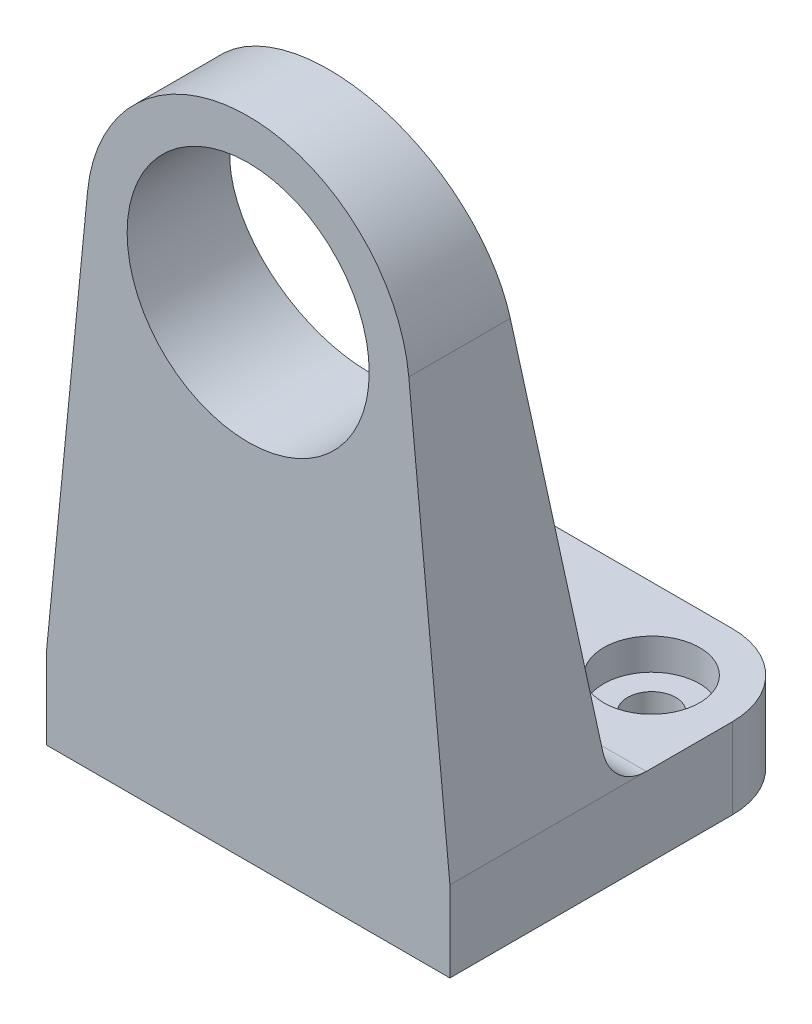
ISO-10303-21;
HEADER;
FILE_DESCRIPTION(('STEP AP214'),'2;1');
FILE_NAME('part.step','',(''),(''),'','','');
FILE_SCHEMA(('AUTOMOTIVE_DESIGN { 1 0 10303 214 1 1 1 1 }'));
ENDSEC;
DATA;
#1=APPLICATION_CONTEXT('core data for automotive mechanical design processes');
#2=APPLICATION_PROTOCOL_DEFINITION('international standard','automotive_design',2000,#1);
#3=PRODUCT_CONTEXT('',#1,'mechanical');
#4=PRODUCT('Part','Part','',(#3));
#5=PRODUCT_RELATED_PRODUCT_CATEGORY('part','',(#4));
#6=PRODUCT_DEFINITION_FORMATION('','',#4);
#7=PRODUCT_DEFINITION_CONTEXT('part definition',#1,'design');
#8=PRODUCT_DEFINITION('design','',#6,#7);
#9=PRODUCT_DEFINITION_SHAPE('','',#8);
#10=(LENGTH_UNIT() NAMED_UNIT(*) SI_UNIT(.MILLI.,.METRE.));
#11=(NAMED_UNIT(*) PLANE_ANGLE_UNIT() SI_UNIT($,.RADIAN.));
#12=(NAMED_UNIT(*) SI_UNIT($,.STERADIAN.) SOLID_ANGLE_UNIT());
#13=UNCERTAINTY_MEASURE_WITH_UNIT(LENGTH_MEASURE(1.E-05),#10,'distance_accuracy_value','');
#14=(GEOMETRIC_REPRESENTATION_CONTEXT(3) GLOBAL_UNCERTAINTY_ASSIGNED_CONTEXT((#13)) GLOBAL_UNIT_ASSIGNED_CONTEXT((#10,
#11,#12)) REPRESENTATION_CONTEXT('',''));
#15=CARTESIAN_POINT('',(0.,0.,0.));
#16=DIRECTION('',(0.,0.,1.));
#17=DIRECTION('',(1.,0.,0.));
#18=AXIS2_PLACEMENT_3D('',#15,#16,#17);
#19=CARTESIAN_POINT('',(15.875,50.8,0.));
#20=DIRECTION('',(0.,0.,-1.));
#21=DIRECTION('',(0.,1.,0.));
#22=AXIS2_PLACEMENT_3D('',#19,#20,#21);
#23=PLANE('',#22);
#24=CARTESIAN_POINT('',(0.,38.1,0.));
#25=DIRECTION('',(0.,0.,1.));
#26=DIRECTION('',(1.,0.,0.));
#27=AXIS2_PLACEMENT_3D('',#24,#25,#26);
#28=CIRCLE('',#27,9.525);
#29=CARTESIAN_POINT('',(9.525,38.1,0.));
#30=VERTEX_POINT('',#29);
#31=EDGE_CURVE('E163',#30,#30,#28,.T.);
#32=ORIENTED_EDGE('',*,*,#31,.F.);
#33=EDGE_LOOP('',(#32));
#34=FACE_BOUND('',#33,.T.);
#35=DIRECTION('',(-0.0976122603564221,0.995224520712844,0.));
#36=VECTOR('',#35,1.);
#37=CARTESIAN_POINT('',(15.875,6.34999999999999,0.));
#38=LINE('',#37,#36);
#39=CARTESIAN_POINT('',(15.875,6.34999999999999,0.));
#40=VERTEX_POINT('',#39);
#41=CARTESIAN_POINT('',(12.6393514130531,39.3396757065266,0.));
#42=VERTEX_POINT('',#41);
#43=EDGE_CURVE('E121',#40,#42,#38,.T.);
#44=ORIENTED_EDGE('',*,*,#43,.T.);
#45=CARTESIAN_POINT('',(0.,38.1,0.));
#46=DIRECTION('',(0.,0.,1.));
#47=DIRECTION('',(1.,0.,0.));
#48=AXIS2_PLACEMENT_3D('',#45,#46,#47);
#49=CIRCLE('',#48,12.7);
#50=CARTESIAN_POINT('',(-12.6393514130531,39.3396757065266,0.));
#51=VERTEX_POINT('',#50);
#52=EDGE_CURVE('E119',#42,#51,#49,.T.);
#53=ORIENTED_EDGE('',*,*,#52,.T.);
#54=DIRECTION('',(-0.0976122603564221,-0.995224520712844,0.));
#55=VECTOR('',#54,1.);
#56=CARTESIAN_POINT('',(-15.875,6.34999999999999,0.));
#57=LINE('',#56,#55);
#58=CARTESIAN_POINT('',(-15.875,6.34999999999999,0.));
#59=VERTEX_POINT('',#58);
#60=EDGE_CURVE('E107',#51,#59,#57,.T.);
#61=ORIENTED_EDGE('',*,*,#60,.T.);
#62=DIRECTION('',(0.,-1.,0.));
#63=VECTOR('',#62,1.);
#64=CARTESIAN_POINT('',(-15.875,50.8,0.));
#65=LINE('',#64,#63);
#66=CARTESIAN_POINT('',(-15.875,0.,0.));
#67=VERTEX_POINT('',#66);
#68=EDGE_CURVE('E117',#59,#67,#65,.T.);
#69=ORIENTED_EDGE('',*,*,#68,.T.);
#70=DIRECTION('',(-1.,0.,0.));
#71=VECTOR('',#70,1.);
#72=CARTESIAN_POINT('',(15.875,0.,0.));
#73=LINE('',#72,#71);
#74=CARTESIAN_POINT('',(15.875,0.,0.));
#75=VERTEX_POINT('',#74);
#76=EDGE_CURVE('E112',#75,#67,#73,.T.);
#77=ORIENTED_EDGE('',*,*,#76,.F.);
#78=DIRECTION('',(0.,-1.,0.));
#79=VECTOR('',#78,1.);
#80=CARTESIAN_POINT('',(15.875,50.8,0.));
#81=LINE('',#80,#79);
#82=EDGE_CURVE('E135',#40,#75,#81,.T.);
#83=ORIENTED_EDGE('',*,*,#82,.F.);
#84=EDGE_LOOP('',(#44,#53,#61,#69,#77,#83));
#85=FACE_BOUND('',#84,.T.);
#86=ADVANCED_FACE('F24',(#34,#85),#23,.F.);
#87=CARTESIAN_POINT('',(15.875,6.34999999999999,-12.7));
#88=DIRECTION('',(0.,-0.14142135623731,0.989949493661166));
#89=DIRECTION('',(0.,-0.989949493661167,-0.14142135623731));
#90=AXIS2_PLACEMENT_3D('',#87,#88,#89);
#91=PLANE('',#90);
#92=CARTESIAN_POINT('',(0.,38.1,-8.16428571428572));
#93=DIRECTION('',(0.,-0.14142135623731,0.989949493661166));
#94=DIRECTION('',(0.,0.989949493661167,0.14142135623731));
#95=AXIS2_PLACEMENT_3D('',#92,#93,#94);
#96=ELLIPSE('',#95,9.62170298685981,9.525);
#97=CARTESIAN_POINT('',(0.,47.625,-6.80357142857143));
#98=VERTEX_POINT('',#97);
#99=EDGE_CURVE('E160',#98,#98,#96,.T.);
#100=ORIENTED_EDGE('',*,*,#99,.T.);
#101=EDGE_LOOP('',(#100));
#102=FACE_BOUND('',#101,.T.);
#103=DIRECTION('',(-0.0966404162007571,0.9853158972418,0.140759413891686));
#104=VECTOR('',#103,1.);
#105=CARTESIAN_POINT('',(15.875,6.34999999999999,-12.7));
#106=LINE('',#105,#104);
#107=CARTESIAN_POINT('',(15.6076334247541,9.07598719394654,-12.3105732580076));
#108=VERTEX_POINT('',#107);
#109=CARTESIAN_POINT('',(12.6393514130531,39.3396757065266,-7.98718918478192));
#110=VERTEX_POINT('',#109);
#111=EDGE_CURVE('E130',#108,#110,#106,.T.);
#112=ORIENTED_EDGE('',*,*,#111,.F.);
#113=DIRECTION('',(-1.,0.,0.));
#114=VECTOR('',#113,1.);
#115=CARTESIAN_POINT('',(-15.875,9.07598719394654,-12.3105732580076));
#116=LINE('',#115,#114);
#117=CARTESIAN_POINT('',(-15.6076334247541,9.07598719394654,-12.3105732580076));
#118=VERTEX_POINT('',#117);
#119=EDGE_CURVE('E150',#108,#118,#116,.T.);
#120=ORIENTED_EDGE('',*,*,#119,.T.);
#121=DIRECTION('',(-0.0966404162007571,-0.9853158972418,-0.140759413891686));
#122=VECTOR('',#121,1.);
#123=CARTESIAN_POINT('',(-15.5784750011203,9.37327749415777,-12.2681032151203));
#124=LINE('',#123,#122);
#125=CARTESIAN_POINT('',(-12.6393514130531,39.3396757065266,-7.98718918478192));
#126=VERTEX_POINT('',#125);
#127=EDGE_CURVE('E207',#126,#118,#124,.T.);
#128=ORIENTED_EDGE('',*,*,#127,.F.);
#129=CARTESIAN_POINT('',(0.,38.1,-8.16428571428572));
#130=DIRECTION('',(0.,-0.14142135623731,0.989949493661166));
#131=DIRECTION('',(0.,0.989949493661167,0.14142135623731));
#132=AXIS2_PLACEMENT_3D('',#129,#130,#131);
#133=ELLIPSE('',#132,12.8289373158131,12.7);
#134=EDGE_CURVE('E126',#110,#126,#133,.T.);
#135=ORIENTED_EDGE('',*,*,#134,.F.);
#136=EDGE_LOOP('',(#112,#120,#128,#135));
#137=FACE_BOUND('',#136,.T.);
#138=ADVANCED_FACE('F205',(#102,#137),#91,.F.);
#139=CARTESIAN_POINT('',(15.875,0.,0.));
#140=DIRECTION('',(1.,0.,0.));
#141=DIRECTION('',(0.,0.,-1.));
#142=AXIS2_PLACEMENT_3D('',#139,#140,#141);
#143=PLANE('',#142);
#144=DIRECTION('',(0.,0.,-1.));
#145=VECTOR('',#144,1.);
#146=CARTESIAN_POINT('',(15.875,0.,0.));
#147=LINE('',#146,#145);
#148=CARTESIAN_POINT('',(15.875,0.,-22.225));
#149=VERTEX_POINT('',#148);
#150=EDGE_CURVE('E137',#75,#149,#147,.T.);
#151=ORIENTED_EDGE('',*,*,#150,.T.);
#152=DIRECTION('',(0.,1.,0.));
#153=VECTOR('',#152,1.);
#154=CARTESIAN_POINT('',(15.875,6.35,-22.225));
#155=LINE('',#154,#153);
#156=CARTESIAN_POINT('',(15.875,6.35,-22.225));
#157=VERTEX_POINT('',#156);
#158=EDGE_CURVE('E159',#149,#157,#155,.T.);
#159=ORIENTED_EDGE('',*,*,#158,.T.);
#160=DIRECTION('',(0.,0.,1.));
#161=VECTOR('',#160,1.);
#162=CARTESIAN_POINT('',(15.875,6.35,-28.575));
#163=LINE('',#162,#161);
#164=CARTESIAN_POINT('',(15.875,6.34999999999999,-15.4536629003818));
#165=VERTEX_POINT('',#164);
#166=EDGE_CURVE('E140',#157,#165,#163,.T.);
#167=ORIENTED_EDGE('',*,*,#166,.T.);
#168=DIRECTION('',(0.,0.,1.));
#169=VECTOR('',#168,1.);
#170=CARTESIAN_POINT('',(15.875,6.34999999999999,0.));
#171=LINE('',#170,#169);
#172=EDGE_CURVE('E111',#165,#40,#171,.T.);
#173=ORIENTED_EDGE('',*,*,#172,.T.);
#174=ORIENTED_EDGE('',*,*,#82,.T.);
#175=EDGE_LOOP('',(#151,#159,#167,#173,#174));
#176=FACE_BOUND('',#175,.T.);
#177=ADVANCED_FACE('F182',(#176),#143,.T.);
#178=CARTESIAN_POINT('',(-15.875,0.,0.));
#179=DIRECTION('',(1.,0.,0.));
#180=DIRECTION('',(0.,0.,-1.));
#181=AXIS2_PLACEMENT_3D('',#178,#179,#180);
#182=PLANE('',#181);
#183=DIRECTION('',(0.,0.,1.));
#184=VECTOR('',#183,1.);
#185=CARTESIAN_POINT('',(-15.875,6.35,-28.575));
#186=LINE('',#185,#184);
#187=CARTESIAN_POINT('',(-15.875,6.35,-22.225));
#188=VERTEX_POINT('',#187);
#189=CARTESIAN_POINT('',(-15.875,6.35,-15.4536629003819));
#190=VERTEX_POINT('',#189);
#191=EDGE_CURVE('E128',#188,#190,#186,.T.);
#192=ORIENTED_EDGE('',*,*,#191,.F.);
#193=DIRECTION('',(0.,1.,0.));
#194=VECTOR('',#193,1.);
#195=CARTESIAN_POINT('',(-15.875,0.,-22.225));
#196=LINE('',#195,#194);
#197=CARTESIAN_POINT('',(-15.875,0.,-22.225));
#198=VERTEX_POINT('',#197);
#199=EDGE_CURVE('E11',#188,#198,#196,.F.);
#200=ORIENTED_EDGE('',*,*,#199,.T.);
#201=DIRECTION('',(0.,0.,-1.));
#202=VECTOR('',#201,1.);
#203=CARTESIAN_POINT('',(-15.875,0.,0.));
#204=LINE('',#203,#202);
#205=EDGE_CURVE('E124',#67,#198,#204,.T.);
#206=ORIENTED_EDGE('',*,*,#205,.F.);
#207=ORIENTED_EDGE('',*,*,#68,.F.);
#208=DIRECTION('',(0.,0.,1.));
#209=VECTOR('',#208,1.);
#210=CARTESIAN_POINT('',(-15.875,6.34999999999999,0.));
#211=LINE('',#210,#209);
#212=EDGE_CURVE('E102',#190,#59,#211,.T.);
#213=ORIENTED_EDGE('',*,*,#212,.F.);
#214=EDGE_LOOP('',(#192,#200,#206,#207,#213));
#215=FACE_BOUND('',#214,.T.);
#216=ADVANCED_FACE('F123',(#215),#182,.F.);
#217=CARTESIAN_POINT('',(15.875,0.,0.));
#218=DIRECTION('',(0.,1.,0.));
#219=DIRECTION('',(0.,0.,1.));
#220=AXIS2_PLACEMENT_3D('',#217,#218,#219);
#221=PLANE('',#220);
#222=CARTESIAN_POINT('',(-9.525,0.,-22.225));
#223=DIRECTION('',(0.,1.,0.));
#224=DIRECTION('',(0.,0.,1.));
#225=AXIS2_PLACEMENT_3D('',#222,#223,#224);
#226=CIRCLE('',#225,1.89865);
#227=CARTESIAN_POINT('',(-9.525,0.,-20.32635));
#228=VERTEX_POINT('',#227);
#229=EDGE_CURVE('E230',#228,#228,#226,.T.);
#230=ORIENTED_EDGE('',*,*,#229,.T.);
#231=EDGE_LOOP('',(#230));
#232=FACE_BOUND('',#231,.T.);
#233=CARTESIAN_POINT('',(9.525,0.,-22.225));
#234=DIRECTION('',(0.,1.,0.));
#235=DIRECTION('',(0.,0.,1.));
#236=AXIS2_PLACEMENT_3D('',#233,#234,#235);
#237=CIRCLE('',#236,1.89865);
#238=CARTESIAN_POINT('',(9.525,0.,-20.32635));
#239=VERTEX_POINT('',#238);
#240=EDGE_CURVE('E218',#239,#239,#237,.T.);
#241=ORIENTED_EDGE('',*,*,#240,.T.);
#242=EDGE_LOOP('',(#241));
#243=FACE_BOUND('',#242,.T.);
#244=DIRECTION('',(-1.,0.,0.));
#245=VECTOR('',#244,1.);
#246=CARTESIAN_POINT('',(15.875,0.,-28.575));
#247=LINE('',#246,#245);
#248=CARTESIAN_POINT('',(9.525,0.,-28.575));
#249=VERTEX_POINT('',#248);
#250=CARTESIAN_POINT('',(-9.525,0.,-28.575));
#251=VERTEX_POINT('',#250);
#252=EDGE_CURVE('E145',#249,#251,#247,.T.);
#253=ORIENTED_EDGE('',*,*,#252,.F.);
#254=CARTESIAN_POINT('',(9.525,0.,-22.225));
#255=DIRECTION('',(0.,1.,0.));
#256=DIRECTION('',(0.,0.,1.));
#257=AXIS2_PLACEMENT_3D('',#254,#255,#256);
#258=CIRCLE('',#257,6.35);
#259=EDGE_CURVE('E31',#249,#149,#258,.F.);
#260=ORIENTED_EDGE('',*,*,#259,.T.);
#261=ORIENTED_EDGE('',*,*,#150,.F.);
#262=ORIENTED_EDGE('',*,*,#76,.T.);
#263=ORIENTED_EDGE('',*,*,#205,.T.);
#264=CARTESIAN_POINT('',(-9.525,0.,-22.225));
#265=DIRECTION('',(0.,1.,0.));
#266=DIRECTION('',(0.,0.,1.));
#267=AXIS2_PLACEMENT_3D('',#264,#265,#266);
#268=CIRCLE('',#267,6.35);
#269=EDGE_CURVE('E43',#198,#251,#268,.F.);
#270=ORIENTED_EDGE('',*,*,#269,.T.);
#271=EDGE_LOOP('',(#253,#260,#261,#262,#263,#270));
#272=FACE_BOUND('',#271,.T.);
#273=ADVANCED_FACE('F177',(#232,#243,#272),#221,.F.);
#274=CARTESIAN_POINT('',(15.875,0.,-28.575));
#275=DIRECTION('',(0.,0.,1.));
#276=DIRECTION('',(1.,0.,0.));
#277=AXIS2_PLACEMENT_3D('',#274,#275,#276);
#278=PLANE('',#277);
#279=DIRECTION('',(-1.,0.,0.));
#280=VECTOR('',#279,1.);
#281=CARTESIAN_POINT('',(15.875,6.35,-28.575));
#282=LINE('',#281,#280);
#283=CARTESIAN_POINT('',(9.525,6.35,-28.575));
#284=VERTEX_POINT('',#283);
#285=CARTESIAN_POINT('',(-9.525,6.35,-28.575));
#286=VERTEX_POINT('',#285);
#287=EDGE_CURVE('E142',#284,#286,#282,.T.);
#288=ORIENTED_EDGE('',*,*,#287,.F.);
#289=DIRECTION('',(0.,1.,0.));
#290=VECTOR('',#289,1.);
#291=CARTESIAN_POINT('',(9.525,0.,-28.575));
#292=LINE('',#291,#290);
#293=EDGE_CURVE('E173',#284,#249,#292,.F.);
#294=ORIENTED_EDGE('',*,*,#293,.T.);
#295=ORIENTED_EDGE('',*,*,#252,.T.);
#296=DIRECTION('',(0.,1.,0.));
#297=VECTOR('',#296,1.);
#298=CARTESIAN_POINT('',(-9.525,0.,-28.575));
#299=LINE('',#298,#297);
#300=EDGE_CURVE('E170',#251,#286,#299,.T.);
#301=ORIENTED_EDGE('',*,*,#300,.T.);
#302=EDGE_LOOP('',(#288,#294,#295,#301));
#303=FACE_BOUND('',#302,.T.);
#304=ADVANCED_FACE('F190',(#303),#278,.F.);
#305=CARTESIAN_POINT('',(15.875,6.35,-28.575));
#306=DIRECTION('',(0.,-1.,0.));
#307=DIRECTION('',(0.,0.,-1.));
#308=AXIS2_PLACEMENT_3D('',#305,#306,#307);
#309=PLANE('',#308);
#310=CARTESIAN_POINT('',(-9.525,6.35,-22.225));
#311=DIRECTION('',(0.,1.,0.));
#312=DIRECTION('',(0.,0.,1.));
#313=AXIS2_PLACEMENT_3D('',#310,#311,#312);
#314=CIRCLE('',#313,3.77062999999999);
#315=CARTESIAN_POINT('',(-9.525,6.35,-18.45437));
#316=VERTEX_POINT('',#315);
#317=EDGE_CURVE('E239',#316,#316,#314,.T.);
#318=ORIENTED_EDGE('',*,*,#317,.F.);
#319=EDGE_LOOP('',(#318));
#320=FACE_BOUND('',#319,.T.);
#321=CARTESIAN_POINT('',(9.525,6.35,-22.225));
#322=DIRECTION('',(0.,1.,0.));
#323=DIRECTION('',(0.,0.,1.));
#324=AXIS2_PLACEMENT_3D('',#321,#322,#323);
#325=CIRCLE('',#324,3.77062999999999);
#326=CARTESIAN_POINT('',(9.525,6.35,-18.45437));
#327=VERTEX_POINT('',#326);
#328=EDGE_CURVE('E227',#327,#327,#325,.T.);
#329=ORIENTED_EDGE('',*,*,#328,.F.);
#330=EDGE_LOOP('',(#329));
#331=FACE_BOUND('',#330,.T.);
#332=ORIENTED_EDGE('',*,*,#166,.F.);
#333=CARTESIAN_POINT('',(9.525,6.35,-22.225));
#334=DIRECTION('',(0.,-1.,0.));
#335=DIRECTION('',(0.,0.,-1.));
#336=AXIS2_PLACEMENT_3D('',#333,#334,#335);
#337=CIRCLE('',#336,6.35);
#338=EDGE_CURVE('E168',#157,#284,#337,.F.);
#339=ORIENTED_EDGE('',*,*,#338,.T.);
#340=ORIENTED_EDGE('',*,*,#287,.T.);
#341=CARTESIAN_POINT('',(-9.525,6.35,-22.225));
#342=DIRECTION('',(0.,-1.,0.));
#343=DIRECTION('',(0.,0.,-1.));
#344=AXIS2_PLACEMENT_3D('',#341,#342,#343);
#345=CIRCLE('',#344,6.35);
#346=EDGE_CURVE('E166',#286,#188,#345,.F.);
#347=ORIENTED_EDGE('',*,*,#346,.T.);
#348=ORIENTED_EDGE('',*,*,#191,.T.);
#349=DIRECTION('',(-1.,0.,0.));
#350=VECTOR('',#349,1.);
#351=CARTESIAN_POINT('',(15.875,6.35,-15.4536629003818));
#352=LINE('',#351,#350);
#353=EDGE_CURVE('E153',#190,#165,#352,.F.);
#354=ORIENTED_EDGE('',*,*,#353,.T.);
#355=EDGE_LOOP('',(#332,#339,#340,#347,#348,#354));
#356=FACE_BOUND('',#355,.T.);
#357=ADVANCED_FACE('F188',(#320,#331,#356),#309,.F.);
#358=CARTESIAN_POINT('',(0.,38.1,-28.575));
#359=DIRECTION('',(0.,0.,1.));
#360=DIRECTION('',(1.,0.,0.));
#361=AXIS2_PLACEMENT_3D('',#358,#359,#360);
#362=CYLINDRICAL_SURFACE('',#361,12.7);
#363=ORIENTED_EDGE('',*,*,#134,.T.);
#364=DIRECTION('',(0.,0.,1.));
#365=VECTOR('',#364,1.);
#366=CARTESIAN_POINT('',(-12.6393514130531,39.3396757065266,-28.575));
#367=LINE('',#366,#365);
#368=EDGE_CURVE('E211',#126,#51,#367,.T.);
#369=ORIENTED_EDGE('',*,*,#368,.T.);
#370=ORIENTED_EDGE('',*,*,#52,.F.);
#371=DIRECTION('',(0.,0.,1.));
#372=VECTOR('',#371,1.);
#373=CARTESIAN_POINT('',(12.6393514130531,39.3396757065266,-28.575));
#374=LINE('',#373,#372);
#375=EDGE_CURVE('E208',#110,#42,#374,.T.);
#376=ORIENTED_EDGE('',*,*,#375,.F.);
#377=EDGE_LOOP('',(#363,#369,#370,#376));
#378=FACE_BOUND('',#377,.T.);
#379=ADVANCED_FACE('F247',(#378),#362,.T.);
#380=CARTESIAN_POINT('',(15.875,6.34999999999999,-28.575));
#381=DIRECTION('',(0.995224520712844,0.0976122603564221,0.));
#382=DIRECTION('',(-0.0976122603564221,0.995224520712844,0.));
#383=AXIS2_PLACEMENT_3D('',#380,#381,#382);
#384=PLANE('',#383);
#385=ORIENTED_EDGE('',*,*,#172,.F.);
#386=CARTESIAN_POINT('',(15.5635939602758,9.525,-15.4536629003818));
#387=DIRECTION('',(0.995224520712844,0.0976122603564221,0.));
#388=DIRECTION('',(0.0976122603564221,-0.995224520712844,0.));
#389=AXIS2_PLACEMENT_3D('',#386,#387,#388);
#390=ELLIPSE('',#389,3.1902349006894,3.175);
#391=EDGE_CURVE('E157',#165,#108,#390,.F.);
#392=ORIENTED_EDGE('',*,*,#391,.T.);
#393=ORIENTED_EDGE('',*,*,#111,.T.);
#394=ORIENTED_EDGE('',*,*,#375,.T.);
#395=ORIENTED_EDGE('',*,*,#43,.F.);
#396=EDGE_LOOP('',(#385,#392,#393,#394,#395));
#397=FACE_BOUND('',#396,.T.);
#398=ADVANCED_FACE('F201',(#397),#384,.T.);
#399=CARTESIAN_POINT('',(-15.875,6.34999999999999,-28.575));
#400=DIRECTION('',(-0.995224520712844,0.0976122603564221,0.));
#401=DIRECTION('',(-0.0976122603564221,-0.995224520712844,0.));
#402=AXIS2_PLACEMENT_3D('',#399,#400,#401);
#403=PLANE('',#402);
#404=ORIENTED_EDGE('',*,*,#127,.T.);
#405=CARTESIAN_POINT('',(-15.5635939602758,9.525,-15.4536629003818));
#406=DIRECTION('',(-0.995224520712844,0.0976122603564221,0.));
#407=DIRECTION('',(0.0976122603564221,0.995224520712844,0.));
#408=AXIS2_PLACEMENT_3D('',#405,#406,#407);
#409=ELLIPSE('',#408,3.1902349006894,3.175);
#410=EDGE_CURVE('E108',#118,#190,#409,.F.);
#411=ORIENTED_EDGE('',*,*,#410,.T.);
#412=ORIENTED_EDGE('',*,*,#212,.T.);
#413=ORIENTED_EDGE('',*,*,#60,.F.);
#414=ORIENTED_EDGE('',*,*,#368,.F.);
#415=EDGE_LOOP('',(#404,#411,#412,#413,#414));
#416=FACE_BOUND('',#415,.T.);
#417=ADVANCED_FACE('F105',(#416),#403,.T.);
#418=CARTESIAN_POINT('',(15.875,9.525,-15.4536629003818));
#419=DIRECTION('',(1.,0.,0.));
#420=DIRECTION('',(0.,0.,-1.));
#421=AXIS2_PLACEMENT_3D('',#418,#419,#420);
#422=CYLINDRICAL_SURFACE('',#421,3.175);
#423=ORIENTED_EDGE('',*,*,#391,.F.);
#424=ORIENTED_EDGE('',*,*,#353,.F.);
#425=ORIENTED_EDGE('',*,*,#410,.F.);
#426=ORIENTED_EDGE('',*,*,#119,.F.);
#427=EDGE_LOOP('',(#423,#424,#425,#426));
#428=FACE_BOUND('',#427,.T.);
#429=ADVANCED_FACE('F197',(#428),#422,.F.);
#430=CARTESIAN_POINT('',(0.,38.1,-28.575));
#431=DIRECTION('',(0.,0.,1.));
#432=DIRECTION('',(1.,0.,0.));
#433=AXIS2_PLACEMENT_3D('',#430,#431,#432);
#434=CYLINDRICAL_SURFACE('',#433,9.525);
#435=ORIENTED_EDGE('',*,*,#31,.T.);
#436=EDGE_LOOP('',(#435));
#437=FACE_BOUND('',#436,.T.);
#438=ORIENTED_EDGE('',*,*,#99,.F.);
#439=EDGE_LOOP('',(#438));
#440=FACE_BOUND('',#439,.T.);
#441=ADVANCED_FACE('F278',(#437,#440),#434,.F.);
#442=CARTESIAN_POINT('',(9.525,0.,-22.225));
#443=DIRECTION('',(0.,-1.,0.));
#444=DIRECTION('',(0.,0.,-1.));
#445=AXIS2_PLACEMENT_3D('',#442,#443,#444);
#446=CYLINDRICAL_SURFACE('',#445,6.35);
#447=ORIENTED_EDGE('',*,*,#259,.F.);
#448=ORIENTED_EDGE('',*,*,#293,.F.);
#449=ORIENTED_EDGE('',*,*,#338,.F.);
#450=ORIENTED_EDGE('',*,*,#158,.F.);
#451=EDGE_LOOP('',(#447,#448,#449,#450));
#452=FACE_BOUND('',#451,.T.);
#453=ADVANCED_FACE('F185',(#452),#446,.T.);
#454=CARTESIAN_POINT('',(-9.525,0.,-22.225));
#455=DIRECTION('',(0.,1.,0.));
#456=DIRECTION('',(0.,0.,1.));
#457=AXIS2_PLACEMENT_3D('',#454,#455,#456);
#458=CYLINDRICAL_SURFACE('',#457,6.35);
#459=ORIENTED_EDGE('',*,*,#269,.F.);
#460=ORIENTED_EDGE('',*,*,#199,.F.);
#461=ORIENTED_EDGE('',*,*,#346,.F.);
#462=ORIENTED_EDGE('',*,*,#300,.F.);
#463=EDGE_LOOP('',(#459,#460,#461,#462));
#464=FACE_BOUND('',#463,.T.);
#465=ADVANCED_FACE('F193',(#464),#458,.T.);
#466=CARTESIAN_POINT('',(9.525,6.35,-22.225));
#467=DIRECTION('',(0.,1.,0.));
#468=DIRECTION('',(0.,0.,1.));
#469=AXIS2_PLACEMENT_3D('',#466,#467,#468);
#470=CYLINDRICAL_SURFACE('',#469,1.89865);
#471=ORIENTED_EDGE('',*,*,#240,.F.);
#472=EDGE_LOOP('',(#471));
#473=FACE_BOUND('',#472,.T.);
#474=CARTESIAN_POINT('',(9.525,3.8862,-22.225));
#475=DIRECTION('',(0.,1.,0.));
#476=DIRECTION('',(0.,0.,1.));
#477=AXIS2_PLACEMENT_3D('',#474,#475,#476);
#478=CIRCLE('',#477,1.89865);
#479=CARTESIAN_POINT('',(9.525,3.8862,-20.32635));
#480=VERTEX_POINT('',#479);
#481=EDGE_CURVE('E221',#480,#480,#478,.T.);
#482=ORIENTED_EDGE('',*,*,#481,.T.);
#483=EDGE_LOOP('',(#482));
#484=FACE_BOUND('',#483,.T.);
#485=ADVANCED_FACE('F264',(#473,#484),#470,.F.);
#486=CARTESIAN_POINT('',(11.42365,3.8862,-22.225));
#487=DIRECTION('',(0.,-1.,0.));
#488=DIRECTION('',(0.,0.,-1.));
#489=AXIS2_PLACEMENT_3D('',#486,#487,#488);
#490=PLANE('',#489);
#491=ORIENTED_EDGE('',*,*,#481,.F.);
#492=EDGE_LOOP('',(#491));
#493=FACE_BOUND('',#492,.T.);
#494=CARTESIAN_POINT('',(9.525,3.8862,-22.225));
#495=DIRECTION('',(0.,1.,0.));
#496=DIRECTION('',(0.,0.,1.));
#497=AXIS2_PLACEMENT_3D('',#494,#495,#496);
#498=CIRCLE('',#497,3.77063);
#499=CARTESIAN_POINT('',(9.525,3.8862,-18.45437));
#500=VERTEX_POINT('',#499);
#501=EDGE_CURVE('E224',#500,#500,#498,.T.);
#502=ORIENTED_EDGE('',*,*,#501,.T.);
#503=EDGE_LOOP('',(#502));
#504=FACE_BOUND('',#503,.T.);
#505=ADVANCED_FACE('F254',(#493,#504),#490,.F.);
#506=CARTESIAN_POINT('',(9.525,6.35,-22.225));
#507=DIRECTION('',(0.,1.,0.));
#508=DIRECTION('',(0.,0.,1.));
#509=AXIS2_PLACEMENT_3D('',#506,#507,#508);
#510=CYLINDRICAL_SURFACE('',#509,3.77062999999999);
#511=ORIENTED_EDGE('',*,*,#501,.F.);
#512=EDGE_LOOP('',(#511));
#513=FACE_BOUND('',#512,.T.);
#514=ORIENTED_EDGE('',*,*,#328,.T.);
#515=EDGE_LOOP('',(#514));
#516=FACE_BOUND('',#515,.T.);
#517=ADVANCED_FACE('F251',(#513,#516),#510,.F.);
#518=CARTESIAN_POINT('',(-9.525,6.35,-22.225));
#519=DIRECTION('',(0.,1.,0.));
#520=DIRECTION('',(0.,0.,1.));
#521=AXIS2_PLACEMENT_3D('',#518,#519,#520);
#522=CYLINDRICAL_SURFACE('',#521,1.89865);
#523=ORIENTED_EDGE('',*,*,#229,.F.);
#524=EDGE_LOOP('',(#523));
#525=FACE_BOUND('',#524,.T.);
#526=CARTESIAN_POINT('',(-9.525,3.8862,-22.225));
#527=DIRECTION('',(0.,1.,0.));
#528=DIRECTION('',(0.,0.,1.));
#529=AXIS2_PLACEMENT_3D('',#526,#527,#528);
#530=CIRCLE('',#529,1.89865);
#531=CARTESIAN_POINT('',(-9.525,3.8862,-20.32635));
#532=VERTEX_POINT('',#531);
#533=EDGE_CURVE('E233',#532,#532,#530,.T.);
#534=ORIENTED_EDGE('',*,*,#533,.T.);
#535=EDGE_LOOP('',(#534));
#536=FACE_BOUND('',#535,.T.);
#537=ADVANCED_FACE('F253',(#525,#536),#522,.F.);
#538=CARTESIAN_POINT('',(-7.62635,3.8862,-22.225));
#539=DIRECTION('',(0.,-1.,0.));
#540=DIRECTION('',(0.,0.,-1.));
#541=AXIS2_PLACEMENT_3D('',#538,#539,#540);
#542=PLANE('',#541);
#543=ORIENTED_EDGE('',*,*,#533,.F.);
#544=EDGE_LOOP('',(#543));
#545=FACE_BOUND('',#544,.T.);
#546=CARTESIAN_POINT('',(-9.525,3.8862,-22.225));
#547=DIRECTION('',(0.,1.,0.));
#548=DIRECTION('',(0.,0.,1.));
#549=AXIS2_PLACEMENT_3D('',#546,#547,#548);
#550=CIRCLE('',#549,3.77063);
#551=CARTESIAN_POINT('',(-9.525,3.8862,-18.45437));
#552=VERTEX_POINT('',#551);
#553=EDGE_CURVE('E236',#552,#552,#550,.T.);
#554=ORIENTED_EDGE('',*,*,#553,.T.);
#555=EDGE_LOOP('',(#554));
#556=FACE_BOUND('',#555,.T.);
#557=ADVANCED_FACE('F261',(#545,#556),#542,.F.);
#558=CARTESIAN_POINT('',(-9.525,6.35,-22.225));
#559=DIRECTION('',(0.,1.,0.));
#560=DIRECTION('',(0.,0.,1.));
#561=AXIS2_PLACEMENT_3D('',#558,#559,#560);
#562=CYLINDRICAL_SURFACE('',#561,3.77062999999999);
#563=ORIENTED_EDGE('',*,*,#553,.F.);
#564=EDGE_LOOP('',(#563));
#565=FACE_BOUND('',#564,.T.);
#566=ORIENTED_EDGE('',*,*,#317,.T.);
#567=EDGE_LOOP('',(#566));
#568=FACE_BOUND('',#567,.T.);
#569=ADVANCED_FACE('F243',(#565,#568),#562,.F.);
#570=CLOSED_SHELL('',(#86,#138,#177,#216,#273,#304,#357,#379,#398,#417,#429,#441,#453,#465,#485,
#505,#517,#537,#557,#569));
#571=MANIFOLD_SOLID_BREP('B2',#570);
#572=ADVANCED_BREP_SHAPE_REPRESENTATION('',(#18,#571),#14);
#573=SHAPE_DEFINITION_REPRESENTATION(#9,#572);
ENDSEC;
END-ISO-10303-21;
